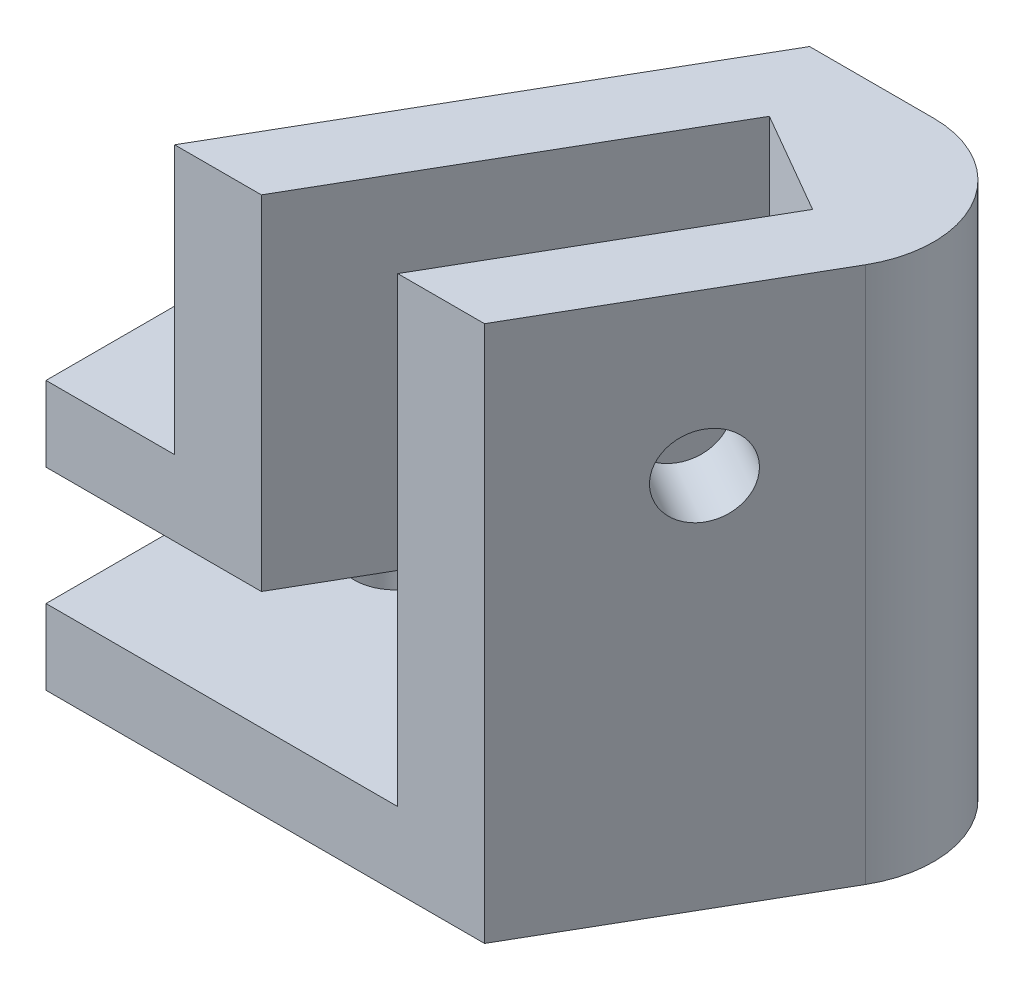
ISO-10303-21;
HEADER;
FILE_DESCRIPTION(('STEP AP214'),'2;1');
FILE_NAME('part.step','',(''),(''),'','','');
FILE_SCHEMA(('AUTOMOTIVE_DESIGN { 1 0 10303 214 1 1 1 1 }'));
ENDSEC;
DATA;
#1=APPLICATION_CONTEXT('core data for automotive mechanical design processes');
#2=APPLICATION_PROTOCOL_DEFINITION('international standard','automotive_design',2000,#1);
#3=PRODUCT_CONTEXT('',#1,'mechanical');
#4=PRODUCT('Part','Part','',(#3));
#5=PRODUCT_RELATED_PRODUCT_CATEGORY('part','',(#4));
#6=PRODUCT_DEFINITION_FORMATION('','',#4);
#7=PRODUCT_DEFINITION_CONTEXT('part definition',#1,'design');
#8=PRODUCT_DEFINITION('design','',#6,#7);
#9=PRODUCT_DEFINITION_SHAPE('','',#8);
#10=(LENGTH_UNIT() NAMED_UNIT(*) SI_UNIT(.MILLI.,.METRE.));
#11=(NAMED_UNIT(*) PLANE_ANGLE_UNIT() SI_UNIT($,.RADIAN.));
#12=(NAMED_UNIT(*) SI_UNIT($,.STERADIAN.) SOLID_ANGLE_UNIT());
#13=UNCERTAINTY_MEASURE_WITH_UNIT(LENGTH_MEASURE(1.E-05),#10,'distance_accuracy_value','');
#14=(GEOMETRIC_REPRESENTATION_CONTEXT(3) GLOBAL_UNCERTAINTY_ASSIGNED_CONTEXT((#13)) GLOBAL_UNIT_ASSIGNED_CONTEXT((#10,
#11,#12)) REPRESENTATION_CONTEXT('',''));
#15=CARTESIAN_POINT('',(0.,0.,0.));
#16=DIRECTION('',(0.,0.,1.));
#17=DIRECTION('',(1.,0.,0.));
#18=AXIS2_PLACEMENT_3D('',#15,#16,#17);
#19=CARTESIAN_POINT('',(7.53478768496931,3.,-4.5));
#20=DIRECTION('',(0.,0.,-1.));
#21=DIRECTION('',(-1.,0.,0.));
#22=AXIS2_PLACEMENT_3D('',#19,#20,#21);
#23=PLANE('',#22);
#24=DIRECTION('',(1.,0.,0.));
#25=VECTOR('',#24,1.);
#26=CARTESIAN_POINT('',(7.53478768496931,7.2,-4.5));
#27=LINE('',#26,#25);
#28=CARTESIAN_POINT('',(2.45410531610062,7.2,-4.5));
#29=VERTEX_POINT('',#28);
#30=CARTESIAN_POINT('',(7.53478768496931,7.2,-4.5));
#31=VERTEX_POINT('',#30);
#32=EDGE_CURVE('E140',#29,#31,#27,.T.);
#33=ORIENTED_EDGE('',*,*,#32,.F.);
#34=DIRECTION('',(-1.,0.,0.));
#35=VECTOR('',#34,1.);
#36=CARTESIAN_POINT('',(17.8405543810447,7.2,-4.5));
#37=LINE('',#36,#35);
#38=CARTESIAN_POINT('',(-12.5,7.2,-4.5));
#39=VERTEX_POINT('',#38);
#40=EDGE_CURVE('E174',#29,#39,#37,.T.);
#41=ORIENTED_EDGE('',*,*,#40,.T.);
#42=DIRECTION('',(0.,-1.,0.));
#43=VECTOR('',#42,1.);
#44=CARTESIAN_POINT('',(-12.5,7.2,-4.5));
#45=LINE('',#44,#43);
#46=CARTESIAN_POINT('',(-12.5,2.8,-4.5));
#47=VERTEX_POINT('',#46);
#48=EDGE_CURVE('E175',#39,#47,#45,.T.);
#49=ORIENTED_EDGE('',*,*,#48,.T.);
#50=DIRECTION('',(-1.,0.,0.));
#51=VECTOR('',#50,1.);
#52=CARTESIAN_POINT('',(17.8405543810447,2.8,-4.5));
#53=LINE('',#52,#51);
#54=CARTESIAN_POINT('',(7.53478768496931,2.8,-4.5));
#55=VERTEX_POINT('',#54);
#56=EDGE_CURVE('E143',#55,#47,#53,.T.);
#57=ORIENTED_EDGE('',*,*,#56,.F.);
#58=DIRECTION('',(0.,1.,0.));
#59=VECTOR('',#58,1.);
#60=CARTESIAN_POINT('',(7.53478768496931,3.,-4.5));
#61=LINE('',#60,#59);
#62=EDGE_CURVE('E137',#55,#31,#61,.T.);
#63=ORIENTED_EDGE('',*,*,#62,.T.);
#64=EDGE_LOOP('',(#33,#41,#49,#57,#63));
#65=FACE_BOUND('',#64,.T.);
#66=ADVANCED_FACE('F35',(#65),#23,.F.);
#67=CARTESIAN_POINT('',(-12.5,10.,7.5));
#68=DIRECTION('',(0.,0.,-1.));
#69=DIRECTION('',(-1.,0.,0.));
#70=AXIS2_PLACEMENT_3D('',#67,#68,#69);
#71=PLANE('',#70);
#72=DIRECTION('',(0.,-1.,0.));
#73=VECTOR('',#72,1.);
#74=CARTESIAN_POINT('',(-12.5,10.,7.5));
#75=LINE('',#74,#73);
#76=CARTESIAN_POINT('',(-12.5,10.,7.5));
#77=VERTEX_POINT('',#76);
#78=CARTESIAN_POINT('',(-12.5,7.2,7.5));
#79=VERTEX_POINT('',#78);
#80=EDGE_CURVE('E234',#77,#79,#75,.T.);
#81=ORIENTED_EDGE('',*,*,#80,.T.);
#82=DIRECTION('',(-1.,0.,0.));
#83=VECTOR('',#82,1.);
#84=CARTESIAN_POINT('',(17.8405543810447,7.2,7.5));
#85=LINE('',#84,#83);
#86=CARTESIAN_POINT('',(-4.47409791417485,7.2,7.5));
#87=VERTEX_POINT('',#86);
#88=EDGE_CURVE('E184',#87,#79,#85,.T.);
#89=ORIENTED_EDGE('',*,*,#88,.F.);
#90=DIRECTION('',(0.,1.,0.));
#91=VECTOR('',#90,1.);
#92=CARTESIAN_POINT('',(-4.47409791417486,10.,7.5));
#93=LINE('',#92,#91);
#94=CARTESIAN_POINT('',(-4.47409791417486,20.,7.5));
#95=VERTEX_POINT('',#94);
#96=EDGE_CURVE('E196',#87,#95,#93,.T.);
#97=ORIENTED_EDGE('',*,*,#96,.T.);
#98=DIRECTION('',(1.,0.,0.));
#99=VECTOR('',#98,1.);
#100=CARTESIAN_POINT('',(3.83974596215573,20.,7.5));
#101=LINE('',#100,#99);
#102=CARTESIAN_POINT('',(-7.70725942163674,20.,7.5));
#103=VERTEX_POINT('',#102);
#104=EDGE_CURVE('E204',#103,#95,#101,.T.);
#105=ORIENTED_EDGE('',*,*,#104,.F.);
#106=DIRECTION('',(0.,-1.,0.));
#107=VECTOR('',#106,1.);
#108=CARTESIAN_POINT('',(-7.70725942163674,20.,7.5));
#109=LINE('',#108,#107);
#110=CARTESIAN_POINT('',(-7.70725942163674,10.,7.5));
#111=VERTEX_POINT('',#110);
#112=EDGE_CURVE('E213',#103,#111,#109,.T.);
#113=ORIENTED_EDGE('',*,*,#112,.T.);
#114=DIRECTION('',(1.,0.,0.));
#115=VECTOR('',#114,1.);
#116=CARTESIAN_POINT('',(-12.5,10.,7.5));
#117=LINE('',#116,#115);
#118=EDGE_CURVE('E225',#77,#111,#117,.T.);
#119=ORIENTED_EDGE('',*,*,#118,.F.);
#120=EDGE_LOOP('',(#81,#89,#97,#105,#113,#119));
#121=FACE_BOUND('',#120,.T.);
#122=ADVANCED_FACE('F287',(#121),#71,.F.);
#123=CARTESIAN_POINT('',(0.,10.,0.));
#124=DIRECTION('',(0.,-1.,0.));
#125=DIRECTION('',(0.,0.,-1.));
#126=AXIS2_PLACEMENT_3D('',#123,#124,#125);
#127=PLANE('',#126);
#128=CARTESIAN_POINT('',(-7.50000000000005,10.,-0.499999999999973));
#129=DIRECTION('',(0.,-1.,0.));
#130=DIRECTION('',(0.,0.,-1.));
#131=AXIS2_PLACEMENT_3D('',#128,#129,#130);
#132=CIRCLE('',#131,1.49999999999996);
#133=CARTESIAN_POINT('',(-7.50000000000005,10.,-1.99999999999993));
#134=VERTEX_POINT('',#133);
#135=EDGE_CURVE('E170',#134,#134,#132,.T.);
#136=ORIENTED_EDGE('',*,*,#135,.T.);
#137=EDGE_LOOP('',(#136));
#138=FACE_BOUND('',#137,.T.);
#139=DIRECTION('',(-0.499999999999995,0.,0.866025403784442));
#140=VECTOR('',#139,1.);
#141=CARTESIAN_POINT('',(0.952994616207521,10.,-7.5));
#142=LINE('',#141,#140);
#143=CARTESIAN_POINT('',(0.95299461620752,10.,-7.5));
#144=VERTEX_POINT('',#143);
#145=EDGE_CURVE('E198',#144,#111,#142,.T.);
#146=ORIENTED_EDGE('',*,*,#145,.F.);
#147=DIRECTION('',(-1.,0.,0.));
#148=VECTOR('',#147,1.);
#149=CARTESIAN_POINT('',(-12.5,10.,-7.5));
#150=LINE('',#149,#148);
#151=CARTESIAN_POINT('',(-12.5,10.,-7.5));
#152=VERTEX_POINT('',#151);
#153=EDGE_CURVE('E220',#144,#152,#150,.T.);
#154=ORIENTED_EDGE('',*,*,#153,.T.);
#155=DIRECTION('',(0.,0.,1.));
#156=VECTOR('',#155,1.);
#157=CARTESIAN_POINT('',(-12.5,10.,7.5));
#158=LINE('',#157,#156);
#159=EDGE_CURVE('E222',#152,#77,#158,.T.);
#160=ORIENTED_EDGE('',*,*,#159,.T.);
#161=ORIENTED_EDGE('',*,*,#118,.T.);
#162=EDGE_LOOP('',(#146,#154,#160,#161));
#163=FACE_BOUND('',#162,.T.);
#164=ADVANCED_FACE('F268',(#138,#163),#127,.F.);
#165=CARTESIAN_POINT('',(-12.5,10.,-7.5));
#166=DIRECTION('',(0.,0.,1.));
#167=DIRECTION('',(1.,0.,0.));
#168=AXIS2_PLACEMENT_3D('',#165,#166,#167);
#169=PLANE('',#168);
#170=DIRECTION('',(-1.,0.,0.));
#171=VECTOR('',#170,1.);
#172=CARTESIAN_POINT('',(0.952994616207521,20.,-7.5));
#173=LINE('',#172,#171);
#174=CARTESIAN_POINT('',(5.57179676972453,20.,-7.5));
#175=VERTEX_POINT('',#174);
#176=CARTESIAN_POINT('',(0.952994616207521,20.,-7.5));
#177=VERTEX_POINT('',#176);
#178=EDGE_CURVE('E199',#175,#177,#173,.T.);
#179=ORIENTED_EDGE('',*,*,#178,.F.);
#180=DIRECTION('',(0.,-1.,0.));
#181=VECTOR('',#180,1.);
#182=CARTESIAN_POINT('',(5.57179676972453,10.,-7.5));
#183=LINE('',#182,#181);
#184=CARTESIAN_POINT('',(5.57179676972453,0.,-7.5));
#185=VERTEX_POINT('',#184);
#186=EDGE_CURVE('E244',#175,#185,#183,.T.);
#187=ORIENTED_EDGE('',*,*,#186,.T.);
#188=DIRECTION('',(-1.,0.,0.));
#189=VECTOR('',#188,1.);
#190=CARTESIAN_POINT('',(-12.5,0.,-7.5));
#191=LINE('',#190,#189);
#192=CARTESIAN_POINT('',(-12.5,0.,-7.5));
#193=VERTEX_POINT('',#192);
#194=EDGE_CURVE('E219',#185,#193,#191,.T.);
#195=ORIENTED_EDGE('',*,*,#194,.T.);
#196=DIRECTION('',(0.,-1.,0.));
#197=VECTOR('',#196,1.);
#198=CARTESIAN_POINT('',(-12.5,10.,-7.5));
#199=LINE('',#198,#197);
#200=EDGE_CURVE('E237',#152,#193,#199,.T.);
#201=ORIENTED_EDGE('',*,*,#200,.F.);
#202=ORIENTED_EDGE('',*,*,#153,.F.);
#203=DIRECTION('',(0.,-1.,0.));
#204=VECTOR('',#203,1.);
#205=CARTESIAN_POINT('',(0.952994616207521,20.,-7.5));
#206=LINE('',#205,#204);
#207=EDGE_CURVE('E216',#177,#144,#206,.T.);
#208=ORIENTED_EDGE('',*,*,#207,.F.);
#209=EDGE_LOOP('',(#179,#187,#195,#201,#202,#208));
#210=FACE_BOUND('',#209,.T.);
#211=ADVANCED_FACE('F318',(#210),#169,.F.);
#212=CARTESIAN_POINT('',(-12.5,10.,7.5));
#213=DIRECTION('',(1.,0.,0.));
#214=DIRECTION('',(0.,0.,-1.));
#215=AXIS2_PLACEMENT_3D('',#212,#213,#214);
#216=PLANE('',#215);
#217=ORIENTED_EDGE('',*,*,#48,.F.);
#218=DIRECTION('',(0.,0.,-1.));
#219=VECTOR('',#218,1.);
#220=CARTESIAN_POINT('',(-12.5,7.2,7.5));
#221=LINE('',#220,#219);
#222=EDGE_CURVE('E163',#79,#39,#221,.T.);
#223=ORIENTED_EDGE('',*,*,#222,.F.);
#224=ORIENTED_EDGE('',*,*,#80,.F.);
#225=ORIENTED_EDGE('',*,*,#159,.F.);
#226=ORIENTED_EDGE('',*,*,#200,.T.);
#227=DIRECTION('',(0.,0.,1.));
#228=VECTOR('',#227,1.);
#229=CARTESIAN_POINT('',(-12.5,0.,7.5));
#230=LINE('',#229,#228);
#231=CARTESIAN_POINT('',(-12.5,0.,7.5));
#232=VERTEX_POINT('',#231);
#233=EDGE_CURVE('E229',#193,#232,#230,.T.);
#234=ORIENTED_EDGE('',*,*,#233,.T.);
#235=CARTESIAN_POINT('',(-12.5,2.8,7.5));
#236=VERTEX_POINT('',#235);
#237=EDGE_CURVE('E227',#236,#232,#75,.T.);
#238=ORIENTED_EDGE('',*,*,#237,.F.);
#239=DIRECTION('',(0.,0.,1.));
#240=VECTOR('',#239,1.);
#241=CARTESIAN_POINT('',(-12.5,2.8,7.5));
#242=LINE('',#241,#240);
#243=EDGE_CURVE('E172',#47,#236,#242,.T.);
#244=ORIENTED_EDGE('',*,*,#243,.F.);
#245=EDGE_LOOP('',(#217,#223,#224,#225,#226,#234,#238,#244));
#246=FACE_BOUND('',#245,.T.);
#247=ADVANCED_FACE('F323',(#246),#216,.F.);
#248=DIRECTION('',(0.,-1.,0.));
#249=VECTOR('',#248,1.);
#250=CARTESIAN_POINT('',(0.606584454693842,10.,7.5));
#251=LINE('',#250,#249);
#252=CARTESIAN_POINT('',(0.606584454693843,20.,7.5));
#253=VERTEX_POINT('',#252);
#254=CARTESIAN_POINT('',(0.606584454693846,2.8,7.5));
#255=VERTEX_POINT('',#254);
#256=EDGE_CURVE('E193',#253,#255,#251,.T.);
#257=ORIENTED_EDGE('',*,*,#256,.T.);
#258=DIRECTION('',(-1.,0.,0.));
#259=VECTOR('',#258,1.);
#260=CARTESIAN_POINT('',(17.8405543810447,2.8,7.5));
#261=LINE('',#260,#259);
#262=EDGE_CURVE('E181',#255,#236,#261,.T.);
#263=ORIENTED_EDGE('',*,*,#262,.T.);
#264=ORIENTED_EDGE('',*,*,#237,.T.);
#265=DIRECTION('',(1.,0.,0.));
#266=VECTOR('',#265,1.);
#267=CARTESIAN_POINT('',(-12.5,0.,7.5));
#268=LINE('',#267,#266);
#269=CARTESIAN_POINT('',(3.83974596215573,0.,7.5));
#270=VERTEX_POINT('',#269);
#271=EDGE_CURVE('E223',#232,#270,#268,.T.);
#272=ORIENTED_EDGE('',*,*,#271,.T.);
#273=DIRECTION('',(0.,-1.,0.));
#274=VECTOR('',#273,1.);
#275=CARTESIAN_POINT('',(3.83974596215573,20.,7.5));
#276=LINE('',#275,#274);
#277=CARTESIAN_POINT('',(3.83974596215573,20.,7.5));
#278=VERTEX_POINT('',#277);
#279=EDGE_CURVE('E209',#278,#270,#276,.T.);
#280=ORIENTED_EDGE('',*,*,#279,.F.);
#281=EDGE_CURVE('E203',#253,#278,#101,.T.);
#282=ORIENTED_EDGE('',*,*,#281,.F.);
#283=EDGE_LOOP('',(#257,#263,#264,#272,#280,#282));
#284=FACE_BOUND('',#283,.T.);
#285=ADVANCED_FACE('F294',(#284),#71,.F.);
#286=CARTESIAN_POINT('',(0.,0.,0.));
#287=DIRECTION('',(0.,-1.,0.));
#288=DIRECTION('',(0.,0.,-1.));
#289=AXIS2_PLACEMENT_3D('',#286,#287,#288);
#290=PLANE('',#289);
#291=CARTESIAN_POINT('',(-7.50000000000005,0.,-0.499999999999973));
#292=DIRECTION('',(0.,-1.,0.));
#293=DIRECTION('',(0.,0.,-1.));
#294=AXIS2_PLACEMENT_3D('',#291,#292,#293);
#295=CIRCLE('',#294,1.49999999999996);
#296=CARTESIAN_POINT('',(-7.50000000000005,0.,-1.99999999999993));
#297=VERTEX_POINT('',#296);
#298=EDGE_CURVE('E251',#297,#297,#295,.T.);
#299=ORIENTED_EDGE('',*,*,#298,.F.);
#300=EDGE_LOOP('',(#299));
#301=FACE_BOUND('',#300,.T.);
#302=ORIENTED_EDGE('',*,*,#194,.F.);
#303=CARTESIAN_POINT('',(5.57179676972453,0.,-3.5));
#304=DIRECTION('',(0.,-1.,0.));
#305=DIRECTION('',(0.,0.,-1.));
#306=AXIS2_PLACEMENT_3D('',#303,#304,#305);
#307=CIRCLE('',#306,4.);
#308=CARTESIAN_POINT('',(9.0358983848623,0.,-1.50000000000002));
#309=VERTEX_POINT('',#308);
#310=EDGE_CURVE('E59',#185,#309,#307,.T.);
#311=ORIENTED_EDGE('',*,*,#310,.T.);
#312=DIRECTION('',(0.499999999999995,0.,-0.866025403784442));
#313=VECTOR('',#312,1.);
#314=CARTESIAN_POINT('',(6.12740473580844,0.,3.53765877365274));
#315=LINE('',#314,#313);
#316=EDGE_CURVE('E240',#270,#309,#315,.T.);
#317=ORIENTED_EDGE('',*,*,#316,.F.);
#318=ORIENTED_EDGE('',*,*,#271,.F.);
#319=ORIENTED_EDGE('',*,*,#233,.F.);
#320=EDGE_LOOP('',(#302,#311,#317,#318,#319));
#321=FACE_BOUND('',#320,.T.);
#322=ADVANCED_FACE('F314',(#301,#321),#290,.T.);
#323=CARTESIAN_POINT('',(0.952994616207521,20.,-7.5));
#324=DIRECTION('',(0.866025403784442,0.,0.499999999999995));
#325=DIRECTION('',(0.499999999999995,0.,-0.866025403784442));
#326=AXIS2_PLACEMENT_3D('',#323,#324,#325);
#327=PLANE('',#326);
#328=CARTESIAN_POINT('',(-1.8205080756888,14.,-2.69615242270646));
#329=DIRECTION('',(0.866025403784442,0.,0.499999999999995));
#330=DIRECTION('',(0.499999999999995,0.,-0.866025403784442));
#331=AXIS2_PLACEMENT_3D('',#328,#329,#330);
#332=CIRCLE('',#331,1.5);
#333=CARTESIAN_POINT('',(-1.07050807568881,14.,-3.99519052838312));
#334=VERTEX_POINT('',#333);
#335=EDGE_CURVE('E257',#334,#334,#332,.T.);
#336=ORIENTED_EDGE('',*,*,#335,.T.);
#337=EDGE_LOOP('',(#336));
#338=FACE_BOUND('',#337,.T.);
#339=ORIENTED_EDGE('',*,*,#145,.T.);
#340=ORIENTED_EDGE('',*,*,#112,.F.);
#341=DIRECTION('',(-0.499999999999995,0.,0.866025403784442));
#342=VECTOR('',#341,1.);
#343=CARTESIAN_POINT('',(0.952994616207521,20.,-7.5));
#344=LINE('',#343,#342);
#345=EDGE_CURVE('E201',#177,#103,#344,.T.);
#346=ORIENTED_EDGE('',*,*,#345,.F.);
#347=ORIENTED_EDGE('',*,*,#207,.T.);
#348=EDGE_LOOP('',(#339,#340,#346,#347));
#349=FACE_BOUND('',#348,.T.);
#350=ADVANCED_FACE('F310',(#338,#349),#327,.F.);
#351=CARTESIAN_POINT('',(12.5,20.,-7.5));
#352=DIRECTION('',(-0.866025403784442,0.,-0.499999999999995));
#353=DIRECTION('',(-0.499999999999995,0.,0.866025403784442));
#354=AXIS2_PLACEMENT_3D('',#351,#352,#353);
#355=PLANE('',#354);
#356=CARTESIAN_POINT('',(6.83974596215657,14.,2.30384757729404));
#357=DIRECTION('',(0.866025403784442,0.,0.499999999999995));
#358=DIRECTION('',(0.499999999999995,0.,-0.866025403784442));
#359=AXIS2_PLACEMENT_3D('',#356,#357,#358);
#360=CIRCLE('',#359,1.5);
#361=CARTESIAN_POINT('',(7.58974596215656,14.,1.00480947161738));
#362=VERTEX_POINT('',#361);
#363=EDGE_CURVE('E447',#362,#362,#360,.T.);
#364=ORIENTED_EDGE('',*,*,#363,.F.);
#365=EDGE_LOOP('',(#364));
#366=FACE_BOUND('',#365,.T.);
#367=ORIENTED_EDGE('',*,*,#316,.T.);
#368=DIRECTION('',(0.,-1.,0.));
#369=VECTOR('',#368,1.);
#370=CARTESIAN_POINT('',(9.0358983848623,20.,-1.50000000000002));
#371=LINE('',#370,#369);
#372=CARTESIAN_POINT('',(9.0358983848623,20.,-1.50000000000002));
#373=VERTEX_POINT('',#372);
#374=EDGE_CURVE('E44',#309,#373,#371,.F.);
#375=ORIENTED_EDGE('',*,*,#374,.T.);
#376=DIRECTION('',(0.499999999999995,0.,-0.866025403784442));
#377=VECTOR('',#376,1.);
#378=CARTESIAN_POINT('',(12.5,20.,-7.5));
#379=LINE('',#378,#377);
#380=EDGE_CURVE('E207',#278,#373,#379,.T.);
#381=ORIENTED_EDGE('',*,*,#380,.F.);
#382=ORIENTED_EDGE('',*,*,#279,.T.);
#383=EDGE_LOOP('',(#367,#375,#381,#382));
#384=FACE_BOUND('',#383,.T.);
#385=ADVANCED_FACE('F306',(#366,#384),#355,.F.);
#386=CARTESIAN_POINT('',(0.,20.,0.));
#387=DIRECTION('',(0.,-1.,0.));
#388=DIRECTION('',(0.,0.,-1.));
#389=AXIS2_PLACEMENT_3D('',#386,#387,#388);
#390=PLANE('',#389);
#391=ORIENTED_EDGE('',*,*,#380,.T.);
#392=CARTESIAN_POINT('',(5.57179676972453,20.,-3.5));
#393=DIRECTION('',(0.,-1.,0.));
#394=DIRECTION('',(0.,0.,-1.));
#395=AXIS2_PLACEMENT_3D('',#392,#393,#394);
#396=CIRCLE('',#395,4.);
#397=EDGE_CURVE('E11',#373,#175,#396,.F.);
#398=ORIENTED_EDGE('',*,*,#397,.T.);
#399=ORIENTED_EDGE('',*,*,#178,.T.);
#400=ORIENTED_EDGE('',*,*,#345,.T.);
#401=ORIENTED_EDGE('',*,*,#104,.T.);
#402=DIRECTION('',(-0.499999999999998,0.,0.86602540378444));
#403=VECTOR('',#402,1.);
#404=CARTESIAN_POINT('',(-4.97346772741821,20.,8.36493388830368));
#405=LINE('',#404,#403);
#406=CARTESIAN_POINT('',(2.45410531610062,20.,-4.50000000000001));
#407=VERTEX_POINT('',#406);
#408=EDGE_CURVE('E148',#407,#95,#405,.T.);
#409=ORIENTED_EDGE('',*,*,#408,.F.);
#410=DIRECTION('',(0.86602540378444,0.,0.499999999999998));
#411=VECTOR('',#410,1.);
#412=CARTESIAN_POINT('',(2.45410531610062,20.,-4.50000000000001));
#413=LINE('',#412,#411);
#414=CARTESIAN_POINT('',(6.26461709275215,20.,-2.30000000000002));
#415=VERTEX_POINT('',#414);
#416=EDGE_CURVE('E167',#407,#415,#413,.T.);
#417=ORIENTED_EDGE('',*,*,#416,.T.);
#418=DIRECTION('',(-0.499999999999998,0.,0.86602540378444));
#419=VECTOR('',#418,1.);
#420=CARTESIAN_POINT('',(3.70253360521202,20.,2.13765877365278));
#421=LINE('',#420,#419);
#422=EDGE_CURVE('E242',#415,#253,#421,.T.);
#423=ORIENTED_EDGE('',*,*,#422,.T.);
#424=ORIENTED_EDGE('',*,*,#281,.T.);
#425=EDGE_LOOP('',(#391,#398,#399,#400,#401,#409,#417,#423,#424));
#426=FACE_BOUND('',#425,.T.);
#427=ADVANCED_FACE('F303',(#426),#390,.F.);
#428=CARTESIAN_POINT('',(-4.97346772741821,3.,8.36493388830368));
#429=DIRECTION('',(-0.86602540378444,0.,-0.499999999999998));
#430=DIRECTION('',(-0.499999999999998,0.,0.86602540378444));
#431=AXIS2_PLACEMENT_3D('',#428,#429,#430);
#432=PLANE('',#431);
#433=CARTESIAN_POINT('',(0.604363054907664,14.,-1.29615242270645));
#434=DIRECTION('',(-0.86602540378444,0.,-0.499999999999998));
#435=DIRECTION('',(-0.499999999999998,0.,0.86602540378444));
#436=AXIS2_PLACEMENT_3D('',#433,#434,#435);
#437=CIRCLE('',#436,1.5);
#438=CARTESIAN_POINT('',(-0.145636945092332,14.,0.00288568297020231));
#439=VERTEX_POINT('',#438);
#440=EDGE_CURVE('E262',#439,#439,#437,.T.);
#441=ORIENTED_EDGE('',*,*,#440,.T.);
#442=EDGE_LOOP('',(#441));
#443=FACE_BOUND('',#442,.T.);
#444=ORIENTED_EDGE('',*,*,#96,.F.);
#445=DIRECTION('',(0.499999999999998,0.,-0.86602540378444));
#446=VECTOR('',#445,1.);
#447=CARTESIAN_POINT('',(-4.97346772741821,7.2,8.36493388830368));
#448=LINE('',#447,#446);
#449=EDGE_CURVE('E188',#87,#29,#448,.T.);
#450=ORIENTED_EDGE('',*,*,#449,.T.);
#451=DIRECTION('',(0.,1.,0.));
#452=VECTOR('',#451,1.);
#453=CARTESIAN_POINT('',(2.45410531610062,3.,-4.50000000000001));
#454=LINE('',#453,#452);
#455=EDGE_CURVE('E147',#29,#407,#454,.T.);
#456=ORIENTED_EDGE('',*,*,#455,.T.);
#457=ORIENTED_EDGE('',*,*,#408,.T.);
#458=EDGE_LOOP('',(#444,#450,#456,#457));
#459=FACE_BOUND('',#458,.T.);
#460=ADVANCED_FACE('F297',(#443,#459),#432,.F.);
#461=CARTESIAN_POINT('',(-0.0285008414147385,3.,8.6));
#462=DIRECTION('',(0.86602540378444,0.,0.499999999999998));
#463=DIRECTION('',(0.499999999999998,0.,-0.86602540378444));
#464=AXIS2_PLACEMENT_3D('',#461,#462,#463);
#465=PLANE('',#464);
#466=CARTESIAN_POINT('',(4.41487483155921,14.,0.903847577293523));
#467=DIRECTION('',(0.86602540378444,0.,0.499999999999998));
#468=DIRECTION('',(0.499999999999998,0.,-0.86602540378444));
#469=AXIS2_PLACEMENT_3D('',#466,#467,#468);
#470=CIRCLE('',#469,1.5);
#471=CARTESIAN_POINT('',(5.1648748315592,14.,-0.395190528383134));
#472=VERTEX_POINT('',#471);
#473=EDGE_CURVE('E39',#472,#472,#470,.T.);
#474=ORIENTED_EDGE('',*,*,#473,.T.);
#475=EDGE_LOOP('',(#474));
#476=FACE_BOUND('',#475,.T.);
#477=ORIENTED_EDGE('',*,*,#422,.F.);
#478=DIRECTION('',(0.,1.,0.));
#479=VECTOR('',#478,1.);
#480=CARTESIAN_POINT('',(6.26461709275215,1.66345474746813,-2.30000000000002));
#481=LINE('',#480,#479);
#482=CARTESIAN_POINT('',(6.26461709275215,7.2,-2.30000000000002));
#483=VERTEX_POINT('',#482);
#484=EDGE_CURVE('E154',#483,#415,#481,.T.);
#485=ORIENTED_EDGE('',*,*,#484,.F.);
#486=DIRECTION('',(-0.499999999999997,0.,0.86602540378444));
#487=VECTOR('',#486,1.);
#488=CARTESIAN_POINT('',(6.26461709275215,7.2,-2.30000000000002));
#489=LINE('',#488,#487);
#490=EDGE_CURVE('E151',#31,#483,#489,.T.);
#491=ORIENTED_EDGE('',*,*,#490,.F.);
#492=ORIENTED_EDGE('',*,*,#62,.F.);
#493=DIRECTION('',(-0.499999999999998,0.,0.86602540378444));
#494=VECTOR('',#493,1.);
#495=CARTESIAN_POINT('',(4.91507693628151,2.8,0.0374721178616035));
#496=LINE('',#495,#494);
#497=EDGE_CURVE('E179',#55,#255,#496,.T.);
#498=ORIENTED_EDGE('',*,*,#497,.T.);
#499=ORIENTED_EDGE('',*,*,#256,.F.);
#500=EDGE_LOOP('',(#477,#485,#491,#492,#498,#499));
#501=FACE_BOUND('',#500,.T.);
#502=ADVANCED_FACE('F152',(#476,#501),#465,.F.);
#503=CARTESIAN_POINT('',(17.8405543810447,7.2,7.5));
#504=DIRECTION('',(0.,1.,0.));
#505=DIRECTION('',(0.,0.,1.));
#506=AXIS2_PLACEMENT_3D('',#503,#504,#505);
#507=PLANE('',#506);
#508=CARTESIAN_POINT('',(-7.50000000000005,7.2,-0.499999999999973));
#509=DIRECTION('',(0.,1.,0.));
#510=DIRECTION('',(0.,0.,1.));
#511=AXIS2_PLACEMENT_3D('',#508,#509,#510);
#512=CIRCLE('',#511,1.49999999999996);
#513=CARTESIAN_POINT('',(-7.50000000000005,7.2,0.999999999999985));
#514=VERTEX_POINT('',#513);
#515=EDGE_CURVE('E250',#514,#514,#512,.T.);
#516=ORIENTED_EDGE('',*,*,#515,.T.);
#517=EDGE_LOOP('',(#516));
#518=FACE_BOUND('',#517,.T.);
#519=ORIENTED_EDGE('',*,*,#88,.T.);
#520=ORIENTED_EDGE('',*,*,#222,.T.);
#521=ORIENTED_EDGE('',*,*,#40,.F.);
#522=ORIENTED_EDGE('',*,*,#449,.F.);
#523=EDGE_LOOP('',(#519,#520,#521,#522));
#524=FACE_BOUND('',#523,.T.);
#525=ADVANCED_FACE('F301',(#518,#524),#507,.F.);
#526=CARTESIAN_POINT('',(17.8405543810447,2.8,7.5));
#527=DIRECTION('',(0.,-1.,0.));
#528=DIRECTION('',(0.,0.,-1.));
#529=AXIS2_PLACEMENT_3D('',#526,#527,#528);
#530=PLANE('',#529);
#531=CARTESIAN_POINT('',(-7.50000000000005,2.8,-0.499999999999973));
#532=DIRECTION('',(0.,-1.,0.));
#533=DIRECTION('',(0.,0.,-1.));
#534=AXIS2_PLACEMENT_3D('',#531,#532,#533);
#535=CIRCLE('',#534,1.49999999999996);
#536=CARTESIAN_POINT('',(-7.50000000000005,2.8,-1.99999999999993));
#537=VERTEX_POINT('',#536);
#538=EDGE_CURVE('E248',#537,#537,#535,.T.);
#539=ORIENTED_EDGE('',*,*,#538,.T.);
#540=EDGE_LOOP('',(#539));
#541=FACE_BOUND('',#540,.T.);
#542=ORIENTED_EDGE('',*,*,#56,.T.);
#543=ORIENTED_EDGE('',*,*,#243,.T.);
#544=ORIENTED_EDGE('',*,*,#262,.F.);
#545=ORIENTED_EDGE('',*,*,#497,.F.);
#546=EDGE_LOOP('',(#542,#543,#544,#545));
#547=FACE_BOUND('',#546,.T.);
#548=ADVANCED_FACE('F363',(#541,#547),#530,.F.);
#549=CARTESIAN_POINT('',(2.45410531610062,1.66345474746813,-4.50000000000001));
#550=DIRECTION('',(-0.499999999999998,0.,0.86602540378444));
#551=DIRECTION('',(0.86602540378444,0.,0.499999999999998));
#552=AXIS2_PLACEMENT_3D('',#549,#550,#551);
#553=PLANE('',#552);
#554=DIRECTION('',(-0.86602540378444,0.,-0.499999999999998));
#555=VECTOR('',#554,1.);
#556=CARTESIAN_POINT('',(2.45410531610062,7.2,-4.50000000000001));
#557=LINE('',#556,#555);
#558=EDGE_CURVE('E160',#483,#29,#557,.T.);
#559=ORIENTED_EDGE('',*,*,#558,.F.);
#560=ORIENTED_EDGE('',*,*,#484,.T.);
#561=ORIENTED_EDGE('',*,*,#416,.F.);
#562=ORIENTED_EDGE('',*,*,#455,.F.);
#563=EDGE_LOOP('',(#559,#560,#561,#562));
#564=FACE_BOUND('',#563,.T.);
#565=ADVANCED_FACE('F360',(#564),#553,.T.);
#566=CARTESIAN_POINT('',(17.8405543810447,7.2,7.5));
#567=DIRECTION('',(0.,1.,0.));
#568=DIRECTION('',(0.,0.,1.));
#569=AXIS2_PLACEMENT_3D('',#566,#567,#568);
#570=PLANE('',#569);
#571=ORIENTED_EDGE('',*,*,#32,.T.);
#572=ORIENTED_EDGE('',*,*,#490,.T.);
#573=ORIENTED_EDGE('',*,*,#558,.T.);
#574=EDGE_LOOP('',(#571,#572,#573));
#575=FACE_BOUND('',#574,.T.);
#576=ADVANCED_FACE('F159',(#575),#570,.F.);
#577=CARTESIAN_POINT('',(5.57179676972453,10.,-3.5));
#578=DIRECTION('',(0.,-1.,0.));
#579=DIRECTION('',(0.,0.,-1.));
#580=AXIS2_PLACEMENT_3D('',#577,#578,#579);
#581=CYLINDRICAL_SURFACE('',#580,4.);
#582=ORIENTED_EDGE('',*,*,#397,.F.);
#583=ORIENTED_EDGE('',*,*,#374,.F.);
#584=ORIENTED_EDGE('',*,*,#310,.F.);
#585=ORIENTED_EDGE('',*,*,#186,.F.);
#586=EDGE_LOOP('',(#582,#583,#584,#585));
#587=FACE_BOUND('',#586,.T.);
#588=ADVANCED_FACE('F37',(#587),#581,.T.);
#589=CARTESIAN_POINT('',(-7.50000000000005,20.,-0.499999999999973));
#590=DIRECTION('',(0.,-1.,0.));
#591=DIRECTION('',(0.,0.,-1.));
#592=AXIS2_PLACEMENT_3D('',#589,#590,#591);
#593=CYLINDRICAL_SURFACE('',#592,1.49999999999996);
#594=ORIENTED_EDGE('',*,*,#298,.T.);
#595=EDGE_LOOP('',(#594));
#596=FACE_BOUND('',#595,.T.);
#597=ORIENTED_EDGE('',*,*,#538,.F.);
#598=EDGE_LOOP('',(#597));
#599=FACE_BOUND('',#598,.T.);
#600=ADVANCED_FACE('F274',(#596,#599),#593,.F.);
#601=ORIENTED_EDGE('',*,*,#515,.F.);
#602=EDGE_LOOP('',(#601));
#603=FACE_BOUND('',#602,.T.);
#604=ORIENTED_EDGE('',*,*,#135,.F.);
#605=EDGE_LOOP('',(#604));
#606=FACE_BOUND('',#605,.T.);
#607=ADVANCED_FACE('F271',(#603,#606),#593,.F.);
#608=CARTESIAN_POINT('',(-10.4807621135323,14.,-7.69615242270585));
#609=DIRECTION('',(0.866025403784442,0.,0.499999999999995));
#610=DIRECTION('',(0.499999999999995,0.,-0.866025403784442));
#611=AXIS2_PLACEMENT_3D('',#608,#609,#610);
#612=CYLINDRICAL_SURFACE('',#611,1.5);
#613=ORIENTED_EDGE('',*,*,#363,.T.);
#614=EDGE_LOOP('',(#613));
#615=FACE_BOUND('',#614,.T.);
#616=ORIENTED_EDGE('',*,*,#473,.F.);
#617=EDGE_LOOP('',(#616));
#618=FACE_BOUND('',#617,.T.);
#619=ADVANCED_FACE('F273',(#615,#618),#612,.F.);
#620=ORIENTED_EDGE('',*,*,#440,.F.);
#621=EDGE_LOOP('',(#620));
#622=FACE_BOUND('',#621,.T.);
#623=ORIENTED_EDGE('',*,*,#335,.F.);
#624=EDGE_LOOP('',(#623));
#625=FACE_BOUND('',#624,.T.);
#626=ADVANCED_FACE('F281',(#622,#625),#612,.F.);
#627=CLOSED_SHELL('',(#66,#122,#164,#211,#247,#285,#322,#350,#385,#427,#460,#502,#525,#548,#565,
#576,#588,#600,#607,#619,#626));
#628=MANIFOLD_SOLID_BREP('B2',#627);
#629=ADVANCED_BREP_SHAPE_REPRESENTATION('',(#18,#628),#14);
#630=SHAPE_DEFINITION_REPRESENTATION(#9,#629);
ENDSEC;
END-ISO-10303-21;
